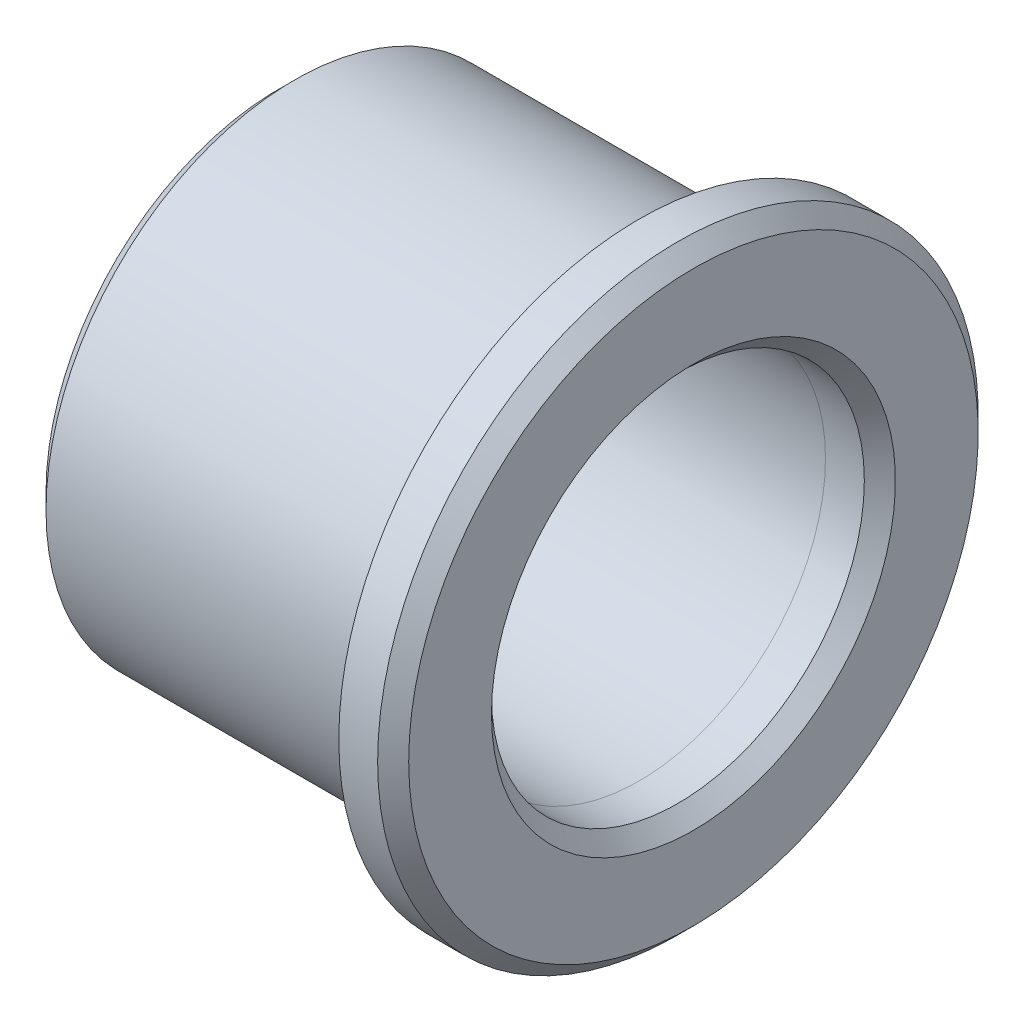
from build123d import *

# Parameters (mm, degrees)
CHANFREIN1_SIZE = 1


with BuildPart() as part:
    # Esquisse2 → R_volution1 (revolve)
    with BuildSketch(Plane.XY.offset(-154.849934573), mode=Mode.PRIVATE) as r_volution1_sk:
        with BuildLine():
            Line((30.327079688, -158.823578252), (53.5, -158.823578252))
            Line((53.5, -158.823578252), (57, -158.823977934))
            Line((57, -158.823977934), (57, -151.496120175))
            Line((57, -151.496120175), (53.5, -151.496120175))
            Line((53.5, -151.496120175), (53.5, -154.400203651))
            ThreePointArc((53.5, -154.400203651), (53.557643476, -154.881621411), (53.076225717, -154.823977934))
            Line((53.076225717, -154.823977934), (30.327079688, -154.823977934))
            Line((30.327079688, -154.823977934), (30.327079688, -158.823578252))
        make_face()
    revolve(r_volution1_sk.sketch.rotate(Axis((16.895715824, -170.823977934, -154.849934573), (1, 0, 0)), 90), axis=Axis((16.895715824, -170.823977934, -154.849934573), (1, 0, 0)))

    # Chanfrein1
    chanfrein1_edges = [part.edges().sort_by_distance(p)[0] for p in [
        (30.327079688, -170.823977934, -166.850334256),
        (30.327079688, -170.823977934, -170.849934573),
        (57, -170.823977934, -174.177792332),
        (57, -170.823977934, -166.849934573),
    ]]
    chamfer(chanfrein1_edges, length=CHANFREIN1_SIZE)


solid = part.part
